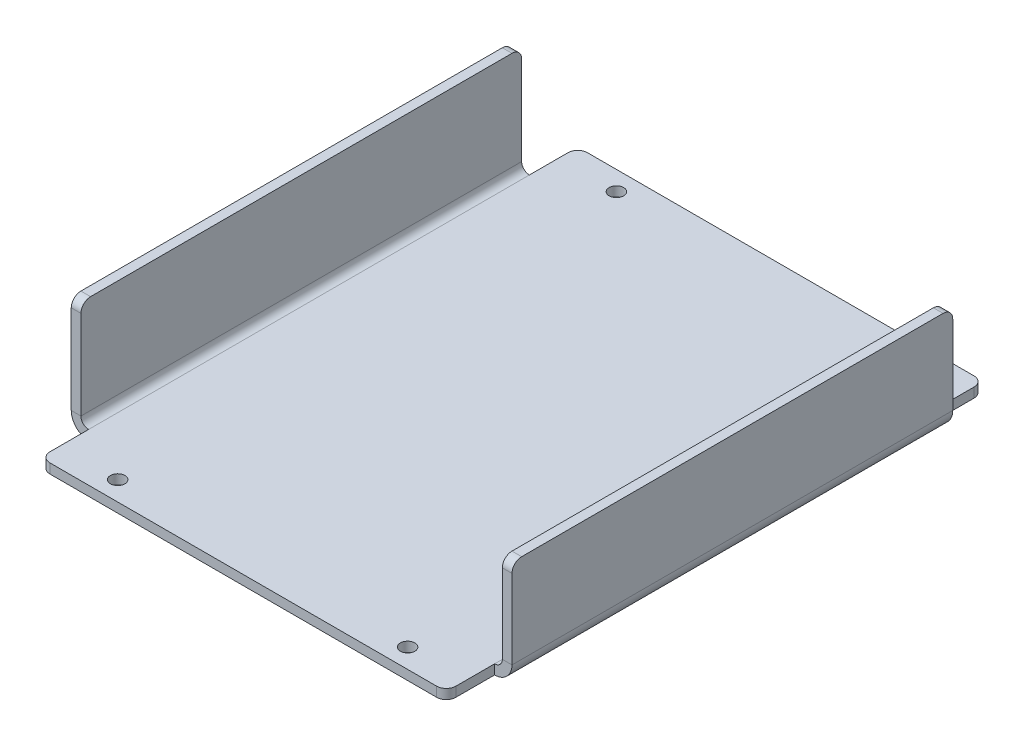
ISO-10303-21;
HEADER;
FILE_DESCRIPTION(('STEP AP214'),'2;1');
FILE_NAME('part.step','',(''),(''),'','','');
FILE_SCHEMA(('AUTOMOTIVE_DESIGN { 1 0 10303 214 1 1 1 1 }'));
ENDSEC;
DATA;
#1=APPLICATION_CONTEXT('core data for automotive mechanical design processes');
#2=APPLICATION_PROTOCOL_DEFINITION('international standard','automotive_design',2000,#1);
#3=PRODUCT_CONTEXT('',#1,'mechanical');
#4=PRODUCT('Part','Part','',(#3));
#5=PRODUCT_RELATED_PRODUCT_CATEGORY('part','',(#4));
#6=PRODUCT_DEFINITION_FORMATION('','',#4);
#7=PRODUCT_DEFINITION_CONTEXT('part definition',#1,'design');
#8=PRODUCT_DEFINITION('design','',#6,#7);
#9=PRODUCT_DEFINITION_SHAPE('','',#8);
#10=(LENGTH_UNIT() NAMED_UNIT(*) SI_UNIT(.MILLI.,.METRE.));
#11=(NAMED_UNIT(*) PLANE_ANGLE_UNIT() SI_UNIT($,.RADIAN.));
#12=(NAMED_UNIT(*) SI_UNIT($,.STERADIAN.) SOLID_ANGLE_UNIT());
#13=UNCERTAINTY_MEASURE_WITH_UNIT(LENGTH_MEASURE(1.E-05),#10,'distance_accuracy_value','');
#14=(GEOMETRIC_REPRESENTATION_CONTEXT(3) GLOBAL_UNCERTAINTY_ASSIGNED_CONTEXT((#13)) GLOBAL_UNIT_ASSIGNED_CONTEXT((#10,
#11,#12)) REPRESENTATION_CONTEXT('',''));
#15=CARTESIAN_POINT('',(0.,0.,0.));
#16=DIRECTION('',(0.,0.,1.));
#17=DIRECTION('',(1.,0.,0.));
#18=AXIS2_PLACEMENT_3D('',#15,#16,#17);
#19=CARTESIAN_POINT('',(-105.,3.99999999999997,278.));
#20=DIRECTION('',(0.,0.,-1.));
#21=DIRECTION('',(-1.,0.,0.));
#22=AXIS2_PLACEMENT_3D('',#19,#20,#21);
#23=CYLINDRICAL_SURFACE('',#22,4.);
#24=DIRECTION('',(0.,0.,-1.));
#25=VECTOR('',#24,1.);
#26=CARTESIAN_POINT('',(-109.,3.99999999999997,278.));
#27=LINE('',#26,#25);
#28=CARTESIAN_POINT('',(-109.,3.99999999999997,253.));
#29=VERTEX_POINT('',#28);
#30=CARTESIAN_POINT('',(-109.,3.99999999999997,25.));
#31=VERTEX_POINT('',#30);
#32=EDGE_CURVE('E237',#29,#31,#27,.T.);
#33=ORIENTED_EDGE('',*,*,#32,.F.);
#34=CARTESIAN_POINT('',(-105.,3.99999999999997,253.));
#35=DIRECTION('',(0.,0.,-1.));
#36=DIRECTION('',(-1.,0.,0.));
#37=AXIS2_PLACEMENT_3D('',#34,#35,#36);
#38=CIRCLE('',#37,4.);
#39=CARTESIAN_POINT('',(-105.,0.,253.));
#40=VERTEX_POINT('',#39);
#41=EDGE_CURVE('E226',#40,#29,#38,.T.);
#42=ORIENTED_EDGE('',*,*,#41,.F.);
#43=DIRECTION('',(0.,0.,-1.));
#44=VECTOR('',#43,1.);
#45=CARTESIAN_POINT('',(-105.,0.,278.));
#46=LINE('',#45,#44);
#47=CARTESIAN_POINT('',(-105.,0.,25.));
#48=VERTEX_POINT('',#47);
#49=EDGE_CURVE('E220',#40,#48,#46,.T.);
#50=ORIENTED_EDGE('',*,*,#49,.T.);
#51=CARTESIAN_POINT('',(-105.,3.99999999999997,25.));
#52=DIRECTION('',(0.,0.,1.));
#53=DIRECTION('',(1.,0.,0.));
#54=AXIS2_PLACEMENT_3D('',#51,#52,#53);
#55=CIRCLE('',#54,4.);
#56=EDGE_CURVE('E334',#31,#48,#55,.T.);
#57=ORIENTED_EDGE('',*,*,#56,.F.);
#58=EDGE_LOOP('',(#33,#42,#50,#57));
#59=FACE_BOUND('',#58,.T.);
#60=ADVANCED_FACE('F46',(#59),#23,.F.);
#61=CARTESIAN_POINT('',(-109.,0.,278.));
#62=DIRECTION('',(1.,0.,0.));
#63=DIRECTION('',(0.,0.,-1.));
#64=AXIS2_PLACEMENT_3D('',#61,#62,#63);
#65=PLANE('',#64);
#66=DIRECTION('',(0.,-1.,0.));
#67=VECTOR('',#66,1.);
#68=CARTESIAN_POINT('',(-109.,0.,25.));
#69=LINE('',#68,#67);
#70=CARTESIAN_POINT('',(-109.,50.,25.));
#71=VERTEX_POINT('',#70);
#72=EDGE_CURVE('E351',#71,#31,#69,.T.);
#73=ORIENTED_EDGE('',*,*,#72,.F.);
#74=CARTESIAN_POINT('',(-109.,50.,30.));
#75=DIRECTION('',(1.,0.,0.));
#76=DIRECTION('',(0.,0.,-1.));
#77=AXIS2_PLACEMENT_3D('',#74,#75,#76);
#78=CIRCLE('',#77,5.);
#79=CARTESIAN_POINT('',(-109.,55.,30.));
#80=VERTEX_POINT('',#79);
#81=EDGE_CURVE('E292',#71,#80,#78,.T.);
#82=ORIENTED_EDGE('',*,*,#81,.T.);
#83=DIRECTION('',(0.,0.,-1.));
#84=VECTOR('',#83,1.);
#85=CARTESIAN_POINT('',(-109.,55.,278.));
#86=LINE('',#85,#84);
#87=CARTESIAN_POINT('',(-109.,55.,248.));
#88=VERTEX_POINT('',#87);
#89=EDGE_CURVE('E245',#88,#80,#86,.T.);
#90=ORIENTED_EDGE('',*,*,#89,.F.);
#91=CARTESIAN_POINT('',(-109.,50.,248.));
#92=DIRECTION('',(1.,0.,0.));
#93=DIRECTION('',(0.,0.,-1.));
#94=AXIS2_PLACEMENT_3D('',#91,#92,#93);
#95=CIRCLE('',#94,5.);
#96=CARTESIAN_POINT('',(-109.,50.,253.));
#97=VERTEX_POINT('',#96);
#98=EDGE_CURVE('E290',#88,#97,#95,.T.);
#99=ORIENTED_EDGE('',*,*,#98,.T.);
#100=DIRECTION('',(0.,1.,0.));
#101=VECTOR('',#100,1.);
#102=CARTESIAN_POINT('',(-109.,0.,253.));
#103=LINE('',#102,#101);
#104=EDGE_CURVE('E442',#29,#97,#103,.T.);
#105=ORIENTED_EDGE('',*,*,#104,.F.);
#106=ORIENTED_EDGE('',*,*,#32,.T.);
#107=EDGE_LOOP('',(#73,#82,#90,#99,#105,#106));
#108=FACE_BOUND('',#107,.T.);
#109=ADVANCED_FACE('F449',(#108),#65,.T.);
#110=CARTESIAN_POINT('',(-114.,55.,278.));
#111=DIRECTION('',(0.,1.,0.));
#112=DIRECTION('',(0.,0.,1.));
#113=AXIS2_PLACEMENT_3D('',#110,#111,#112);
#114=PLANE('',#113);
#115=ORIENTED_EDGE('',*,*,#89,.T.);
#116=DIRECTION('',(1.,0.,0.));
#117=VECTOR('',#116,1.);
#118=CARTESIAN_POINT('',(-114.,55.,30.));
#119=LINE('',#118,#117);
#120=CARTESIAN_POINT('',(-114.,55.,30.));
#121=VERTEX_POINT('',#120);
#122=EDGE_CURVE('E281',#80,#121,#119,.F.);
#123=ORIENTED_EDGE('',*,*,#122,.T.);
#124=DIRECTION('',(0.,0.,-1.));
#125=VECTOR('',#124,1.);
#126=CARTESIAN_POINT('',(-114.,55.,278.));
#127=LINE('',#126,#125);
#128=CARTESIAN_POINT('',(-114.,55.,248.));
#129=VERTEX_POINT('',#128);
#130=EDGE_CURVE('E411',#129,#121,#127,.T.);
#131=ORIENTED_EDGE('',*,*,#130,.F.);
#132=DIRECTION('',(-1.,0.,0.));
#133=VECTOR('',#132,1.);
#134=CARTESIAN_POINT('',(-114.,55.,248.));
#135=LINE('',#134,#133);
#136=EDGE_CURVE('E278',#129,#88,#135,.F.);
#137=ORIENTED_EDGE('',*,*,#136,.T.);
#138=EDGE_LOOP('',(#115,#123,#131,#137));
#139=FACE_BOUND('',#138,.T.);
#140=ADVANCED_FACE('F417',(#139),#114,.T.);
#141=CARTESIAN_POINT('',(-114.,0.,278.));
#142=DIRECTION('',(1.,0.,0.));
#143=DIRECTION('',(0.,0.,-1.));
#144=AXIS2_PLACEMENT_3D('',#141,#142,#143);
#145=PLANE('',#144);
#146=ORIENTED_EDGE('',*,*,#130,.T.);
#147=CARTESIAN_POINT('',(-114.,50.,30.));
#148=DIRECTION('',(1.,0.,0.));
#149=DIRECTION('',(0.,0.,-1.));
#150=AXIS2_PLACEMENT_3D('',#147,#148,#149);
#151=CIRCLE('',#150,5.);
#152=CARTESIAN_POINT('',(-114.,50.,25.));
#153=VERTEX_POINT('',#152);
#154=EDGE_CURVE('E286',#121,#153,#151,.F.);
#155=ORIENTED_EDGE('',*,*,#154,.T.);
#156=DIRECTION('',(0.,1.,0.));
#157=VECTOR('',#156,1.);
#158=CARTESIAN_POINT('',(-114.,0.,25.));
#159=LINE('',#158,#157);
#160=CARTESIAN_POINT('',(-114.,3.99999999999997,25.));
#161=VERTEX_POINT('',#160);
#162=EDGE_CURVE('E353',#153,#161,#159,.F.);
#163=ORIENTED_EDGE('',*,*,#162,.T.);
#164=DIRECTION('',(0.,0.,-1.));
#165=VECTOR('',#164,1.);
#166=CARTESIAN_POINT('',(-114.,3.99999999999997,278.));
#167=LINE('',#166,#165);
#168=CARTESIAN_POINT('',(-114.,3.99999999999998,253.));
#169=VERTEX_POINT('',#168);
#170=EDGE_CURVE('E408',#169,#161,#167,.T.);
#171=ORIENTED_EDGE('',*,*,#170,.F.);
#172=DIRECTION('',(0.,1.,0.));
#173=VECTOR('',#172,1.);
#174=CARTESIAN_POINT('',(-114.,55.,253.));
#175=LINE('',#174,#173);
#176=CARTESIAN_POINT('',(-114.,50.,253.));
#177=VERTEX_POINT('',#176);
#178=EDGE_CURVE('E238',#169,#177,#175,.T.);
#179=ORIENTED_EDGE('',*,*,#178,.T.);
#180=CARTESIAN_POINT('',(-114.,50.,248.));
#181=DIRECTION('',(1.,0.,0.));
#182=DIRECTION('',(0.,0.,-1.));
#183=AXIS2_PLACEMENT_3D('',#180,#181,#182);
#184=CIRCLE('',#183,5.);
#185=EDGE_CURVE('E284',#177,#129,#184,.F.);
#186=ORIENTED_EDGE('',*,*,#185,.T.);
#187=EDGE_LOOP('',(#146,#155,#163,#171,#179,#186));
#188=FACE_BOUND('',#187,.T.);
#189=ADVANCED_FACE('F427',(#188),#145,.F.);
#190=CARTESIAN_POINT('',(-105.,3.99999999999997,278.));
#191=DIRECTION('',(0.,0.,-1.));
#192=DIRECTION('',(-1.,0.,0.));
#193=AXIS2_PLACEMENT_3D('',#190,#191,#192);
#194=CYLINDRICAL_SURFACE('',#193,9.);
#195=CARTESIAN_POINT('',(-105.,3.99999999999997,253.));
#196=DIRECTION('',(0.,0.,-1.));
#197=DIRECTION('',(-1.,0.,0.));
#198=AXIS2_PLACEMENT_3D('',#195,#196,#197);
#199=CIRCLE('',#198,9.);
#200=CARTESIAN_POINT('',(-105.,-5.00000000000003,253.));
#201=VERTEX_POINT('',#200);
#202=EDGE_CURVE('E229',#201,#169,#199,.T.);
#203=ORIENTED_EDGE('',*,*,#202,.T.);
#204=ORIENTED_EDGE('',*,*,#170,.T.);
#205=CARTESIAN_POINT('',(-105.,3.99999999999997,25.));
#206=DIRECTION('',(0.,0.,-1.));
#207=DIRECTION('',(-1.,0.,0.));
#208=AXIS2_PLACEMENT_3D('',#205,#206,#207);
#209=CIRCLE('',#208,9.);
#210=CARTESIAN_POINT('',(-105.,-5.00000000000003,25.));
#211=VERTEX_POINT('',#210);
#212=EDGE_CURVE('E342',#161,#211,#209,.F.);
#213=ORIENTED_EDGE('',*,*,#212,.T.);
#214=DIRECTION('',(0.,0.,-1.));
#215=VECTOR('',#214,1.);
#216=CARTESIAN_POINT('',(-105.,-5.00000000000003,278.));
#217=LINE('',#216,#215);
#218=EDGE_CURVE('E405',#201,#211,#217,.T.);
#219=ORIENTED_EDGE('',*,*,#218,.F.);
#220=EDGE_LOOP('',(#203,#204,#213,#219));
#221=FACE_BOUND('',#220,.T.);
#222=ADVANCED_FACE('F438',(#221),#194,.T.);
#223=CARTESIAN_POINT('',(114.,0.,278.));
#224=DIRECTION('',(-1.,0.,0.));
#225=DIRECTION('',(0.,0.,1.));
#226=AXIS2_PLACEMENT_3D('',#223,#224,#225);
#227=PLANE('',#226);
#228=DIRECTION('',(0.,-1.,0.));
#229=VECTOR('',#228,1.);
#230=CARTESIAN_POINT('',(114.,55.,25.));
#231=LINE('',#230,#229);
#232=CARTESIAN_POINT('',(114.,45.,25.));
#233=VERTEX_POINT('',#232);
#234=CARTESIAN_POINT('',(114.,3.99999999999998,25.));
#235=VERTEX_POINT('',#234);
#236=EDGE_CURVE('E469',#233,#235,#231,.T.);
#237=ORIENTED_EDGE('',*,*,#236,.F.);
#238=CARTESIAN_POINT('',(114.,45.,30.));
#239=DIRECTION('',(-1.,0.,0.));
#240=DIRECTION('',(0.,0.,1.));
#241=AXIS2_PLACEMENT_3D('',#238,#239,#240);
#242=CIRCLE('',#241,5.);
#243=CARTESIAN_POINT('',(114.,50.,30.));
#244=VERTEX_POINT('',#243);
#245=EDGE_CURVE('E305',#233,#244,#242,.F.);
#246=ORIENTED_EDGE('',*,*,#245,.T.);
#247=DIRECTION('',(0.,0.,-1.));
#248=VECTOR('',#247,1.);
#249=CARTESIAN_POINT('',(114.,50.,278.001));
#250=LINE('',#249,#248);
#251=CARTESIAN_POINT('',(114.,50.,248.));
#252=VERTEX_POINT('',#251);
#253=EDGE_CURVE('E358',#252,#244,#250,.T.);
#254=ORIENTED_EDGE('',*,*,#253,.F.);
#255=CARTESIAN_POINT('',(114.,45.,248.));
#256=DIRECTION('',(-1.,0.,0.));
#257=DIRECTION('',(0.,0.,1.));
#258=AXIS2_PLACEMENT_3D('',#255,#256,#257);
#259=CIRCLE('',#258,5.);
#260=CARTESIAN_POINT('',(114.,45.,253.));
#261=VERTEX_POINT('',#260);
#262=EDGE_CURVE('E61',#252,#261,#259,.F.);
#263=ORIENTED_EDGE('',*,*,#262,.T.);
#264=DIRECTION('',(0.,1.,0.));
#265=VECTOR('',#264,1.);
#266=CARTESIAN_POINT('',(114.,55.,253.));
#267=LINE('',#266,#265);
#268=CARTESIAN_POINT('',(114.,3.99999999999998,253.));
#269=VERTEX_POINT('',#268);
#270=EDGE_CURVE('E325',#269,#261,#267,.T.);
#271=ORIENTED_EDGE('',*,*,#270,.F.);
#272=DIRECTION('',(0.,0.,-1.));
#273=VECTOR('',#272,1.);
#274=CARTESIAN_POINT('',(114.,3.99999999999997,278.));
#275=LINE('',#274,#273);
#276=EDGE_CURVE('E399',#269,#235,#275,.T.);
#277=ORIENTED_EDGE('',*,*,#276,.T.);
#278=EDGE_LOOP('',(#237,#246,#254,#263,#271,#277));
#279=FACE_BOUND('',#278,.T.);
#280=ADVANCED_FACE('F515',(#279),#227,.F.);
#281=CARTESIAN_POINT('',(109.,0.,278.));
#282=DIRECTION('',(-1.,0.,0.));
#283=DIRECTION('',(0.,0.,1.));
#284=AXIS2_PLACEMENT_3D('',#281,#282,#283);
#285=PLANE('',#284);
#286=DIRECTION('',(0.,0.,-1.));
#287=VECTOR('',#286,1.);
#288=CARTESIAN_POINT('',(109.,50.,278.001));
#289=LINE('',#288,#287);
#290=CARTESIAN_POINT('',(109.,50.,248.));
#291=VERTEX_POINT('',#290);
#292=CARTESIAN_POINT('',(109.,50.,30.));
#293=VERTEX_POINT('',#292);
#294=EDGE_CURVE('E359',#291,#293,#289,.T.);
#295=ORIENTED_EDGE('',*,*,#294,.T.);
#296=CARTESIAN_POINT('',(109.,45.,30.));
#297=DIRECTION('',(-1.,0.,0.));
#298=DIRECTION('',(0.,0.,1.));
#299=AXIS2_PLACEMENT_3D('',#296,#297,#298);
#300=CIRCLE('',#299,5.);
#301=CARTESIAN_POINT('',(109.,45.,25.));
#302=VERTEX_POINT('',#301);
#303=EDGE_CURVE('E301',#293,#302,#300,.T.);
#304=ORIENTED_EDGE('',*,*,#303,.T.);
#305=DIRECTION('',(0.,1.,0.));
#306=VECTOR('',#305,1.);
#307=CARTESIAN_POINT('',(109.,0.,25.));
#308=LINE('',#307,#306);
#309=CARTESIAN_POINT('',(109.,3.99999999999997,25.));
#310=VERTEX_POINT('',#309);
#311=EDGE_CURVE('E471',#302,#310,#308,.F.);
#312=ORIENTED_EDGE('',*,*,#311,.T.);
#313=DIRECTION('',(0.,0.,-1.));
#314=VECTOR('',#313,1.);
#315=CARTESIAN_POINT('',(109.,3.99999999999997,278.));
#316=LINE('',#315,#314);
#317=CARTESIAN_POINT('',(109.,3.99999999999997,253.));
#318=VERTEX_POINT('',#317);
#319=EDGE_CURVE('E251',#318,#310,#316,.T.);
#320=ORIENTED_EDGE('',*,*,#319,.F.);
#321=DIRECTION('',(0.,1.,0.));
#322=VECTOR('',#321,1.);
#323=CARTESIAN_POINT('',(109.,0.,253.));
#324=LINE('',#323,#322);
#325=CARTESIAN_POINT('',(109.,45.,253.));
#326=VERTEX_POINT('',#325);
#327=EDGE_CURVE('E323',#318,#326,#324,.T.);
#328=ORIENTED_EDGE('',*,*,#327,.T.);
#329=CARTESIAN_POINT('',(109.,45.,248.));
#330=DIRECTION('',(-1.,0.,0.));
#331=DIRECTION('',(0.,0.,1.));
#332=AXIS2_PLACEMENT_3D('',#329,#330,#331);
#333=CIRCLE('',#332,5.);
#334=EDGE_CURVE('E299',#326,#291,#333,.T.);
#335=ORIENTED_EDGE('',*,*,#334,.T.);
#336=EDGE_LOOP('',(#295,#304,#312,#320,#328,#335));
#337=FACE_BOUND('',#336,.T.);
#338=ADVANCED_FACE('F330',(#337),#285,.T.);
#339=CARTESIAN_POINT('',(105.,3.99999999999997,278.));
#340=DIRECTION('',(0.,0.,-1.));
#341=DIRECTION('',(-1.,0.,0.));
#342=AXIS2_PLACEMENT_3D('',#339,#340,#341);
#343=CYLINDRICAL_SURFACE('',#342,4.);
#344=ORIENTED_EDGE('',*,*,#319,.T.);
#345=CARTESIAN_POINT('',(105.,3.99999999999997,25.));
#346=DIRECTION('',(0.,0.,-1.));
#347=DIRECTION('',(-1.,0.,0.));
#348=AXIS2_PLACEMENT_3D('',#345,#346,#347);
#349=CIRCLE('',#348,4.);
#350=CARTESIAN_POINT('',(105.,0.,25.));
#351=VERTEX_POINT('',#350);
#352=EDGE_CURVE('E466',#351,#310,#349,.F.);
#353=ORIENTED_EDGE('',*,*,#352,.F.);
#354=DIRECTION('',(0.,0.,-1.));
#355=VECTOR('',#354,1.);
#356=CARTESIAN_POINT('',(105.,0.,278.));
#357=LINE('',#356,#355);
#358=CARTESIAN_POINT('',(105.,0.,253.));
#359=VERTEX_POINT('',#358);
#360=EDGE_CURVE('E219',#359,#351,#357,.T.);
#361=ORIENTED_EDGE('',*,*,#360,.F.);
#362=CARTESIAN_POINT('',(105.,3.99999999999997,253.));
#363=DIRECTION('',(0.,0.,-1.));
#364=DIRECTION('',(-1.,0.,0.));
#365=AXIS2_PLACEMENT_3D('',#362,#363,#364);
#366=CIRCLE('',#365,4.);
#367=EDGE_CURVE('E336',#318,#359,#366,.T.);
#368=ORIENTED_EDGE('',*,*,#367,.F.);
#369=EDGE_LOOP('',(#344,#353,#361,#368));
#370=FACE_BOUND('',#369,.T.);
#371=ADVANCED_FACE('F496',(#370),#343,.F.);
#372=CARTESIAN_POINT('',(105.,3.99999999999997,278.));
#373=DIRECTION('',(0.,0.,-1.));
#374=DIRECTION('',(-1.,0.,0.));
#375=AXIS2_PLACEMENT_3D('',#372,#373,#374);
#376=CYLINDRICAL_SURFACE('',#375,9.);
#377=CARTESIAN_POINT('',(105.,3.99999999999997,25.));
#378=DIRECTION('',(0.,0.,1.));
#379=DIRECTION('',(1.,0.,0.));
#380=AXIS2_PLACEMENT_3D('',#377,#378,#379);
#381=CIRCLE('',#380,9.);
#382=CARTESIAN_POINT('',(105.,-5.00000000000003,25.0000000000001));
#383=VERTEX_POINT('',#382);
#384=EDGE_CURVE('E463',#383,#235,#381,.T.);
#385=ORIENTED_EDGE('',*,*,#384,.T.);
#386=ORIENTED_EDGE('',*,*,#276,.F.);
#387=CARTESIAN_POINT('',(105.,3.99999999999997,253.));
#388=DIRECTION('',(0.,0.,-1.));
#389=DIRECTION('',(-1.,0.,0.));
#390=AXIS2_PLACEMENT_3D('',#387,#388,#389);
#391=CIRCLE('',#390,9.);
#392=CARTESIAN_POINT('',(105.,-5.00000000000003,253.));
#393=VERTEX_POINT('',#392);
#394=EDGE_CURVE('E479',#269,#393,#391,.T.);
#395=ORIENTED_EDGE('',*,*,#394,.T.);
#396=DIRECTION('',(0.,0.,-1.));
#397=VECTOR('',#396,1.);
#398=CARTESIAN_POINT('',(105.,-5.00000000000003,278.));
#399=LINE('',#398,#397);
#400=EDGE_CURVE('E402',#393,#383,#399,.T.);
#401=ORIENTED_EDGE('',*,*,#400,.T.);
#402=EDGE_LOOP('',(#385,#386,#395,#401));
#403=FACE_BOUND('',#402,.T.);
#404=ADVANCED_FACE('F512',(#403),#376,.T.);
#405=CARTESIAN_POINT('',(114.,50.,278.001));
#406=DIRECTION('',(0.,-1.,0.));
#407=DIRECTION('',(0.,0.,-1.));
#408=AXIS2_PLACEMENT_3D('',#405,#406,#407);
#409=PLANE('',#408);
#410=ORIENTED_EDGE('',*,*,#253,.T.);
#411=DIRECTION('',(-1.,0.,0.));
#412=VECTOR('',#411,1.);
#413=CARTESIAN_POINT('',(109.,50.,30.));
#414=LINE('',#413,#412);
#415=EDGE_CURVE('E296',#244,#293,#414,.T.);
#416=ORIENTED_EDGE('',*,*,#415,.T.);
#417=ORIENTED_EDGE('',*,*,#294,.F.);
#418=DIRECTION('',(-1.,0.,0.));
#419=VECTOR('',#418,1.);
#420=CARTESIAN_POINT('',(114.,50.,248.));
#421=LINE('',#420,#419);
#422=EDGE_CURVE('E294',#291,#252,#421,.F.);
#423=ORIENTED_EDGE('',*,*,#422,.T.);
#424=EDGE_LOOP('',(#410,#416,#417,#423));
#425=FACE_BOUND('',#424,.T.);
#426=ADVANCED_FACE('F522',(#425),#409,.F.);
#427=CARTESIAN_POINT('',(-114.,3.99999999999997,278.));
#428=DIRECTION('',(0.,0.,1.));
#429=DIRECTION('',(1.,0.,0.));
#430=AXIS2_PLACEMENT_3D('',#427,#428,#429);
#431=PLANE('',#430);
#432=DIRECTION('',(1.,0.,0.));
#433=VECTOR('',#432,1.);
#434=CARTESIAN_POINT('',(109.,-5.00000000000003,278.));
#435=LINE('',#434,#433);
#436=CARTESIAN_POINT('',(-100.,-5.00000000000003,278.));
#437=VERTEX_POINT('',#436);
#438=CARTESIAN_POINT('',(100.,-5.00000000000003,278.));
#439=VERTEX_POINT('',#438);
#440=EDGE_CURVE('E396',#437,#439,#435,.T.);
#441=ORIENTED_EDGE('',*,*,#440,.T.);
#442=DIRECTION('',(0.,-1.,0.));
#443=VECTOR('',#442,1.);
#444=CARTESIAN_POINT('',(100.,3.99999999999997,278.));
#445=LINE('',#444,#443);
#446=CARTESIAN_POINT('',(100.,0.,278.));
#447=VERTEX_POINT('',#446);
#448=EDGE_CURVE('E312',#439,#447,#445,.F.);
#449=ORIENTED_EDGE('',*,*,#448,.T.);
#450=DIRECTION('',(1.,0.,0.));
#451=VECTOR('',#450,1.);
#452=CARTESIAN_POINT('',(109.,0.,278.));
#453=LINE('',#452,#451);
#454=CARTESIAN_POINT('',(-100.,0.,278.));
#455=VERTEX_POINT('',#454);
#456=EDGE_CURVE('E393',#455,#447,#453,.T.);
#457=ORIENTED_EDGE('',*,*,#456,.F.);
#458=DIRECTION('',(0.,-1.,0.));
#459=VECTOR('',#458,1.);
#460=CARTESIAN_POINT('',(-100.,3.99999999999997,278.));
#461=LINE('',#460,#459);
#462=EDGE_CURVE('E309',#455,#437,#461,.T.);
#463=ORIENTED_EDGE('',*,*,#462,.T.);
#464=EDGE_LOOP('',(#441,#449,#457,#463));
#465=FACE_BOUND('',#464,.T.);
#466=ADVANCED_FACE('F48',(#465),#431,.T.);
#467=CARTESIAN_POINT('',(114.,3.99999999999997,0.));
#468=DIRECTION('',(0.,0.,-1.));
#469=DIRECTION('',(-1.,0.,0.));
#470=AXIS2_PLACEMENT_3D('',#467,#468,#469);
#471=PLANE('',#470);
#472=DIRECTION('',(1.,0.,0.));
#473=VECTOR('',#472,1.);
#474=CARTESIAN_POINT('',(109.,-5.00000000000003,0.));
#475=LINE('',#474,#473);
#476=CARTESIAN_POINT('',(-100.,-5.00000000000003,0.));
#477=VERTEX_POINT('',#476);
#478=CARTESIAN_POINT('',(100.,-5.00000000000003,0.));
#479=VERTEX_POINT('',#478);
#480=EDGE_CURVE('E390',#477,#479,#475,.T.);
#481=ORIENTED_EDGE('',*,*,#480,.F.);
#482=DIRECTION('',(0.,1.,0.));
#483=VECTOR('',#482,1.);
#484=CARTESIAN_POINT('',(-100.,3.99999999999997,0.));
#485=LINE('',#484,#483);
#486=CARTESIAN_POINT('',(-100.,0.,0.));
#487=VERTEX_POINT('',#486);
#488=EDGE_CURVE('E257',#477,#487,#485,.T.);
#489=ORIENTED_EDGE('',*,*,#488,.T.);
#490=DIRECTION('',(1.,0.,0.));
#491=VECTOR('',#490,1.);
#492=CARTESIAN_POINT('',(109.,0.,0.));
#493=LINE('',#492,#491);
#494=CARTESIAN_POINT('',(100.,0.,0.));
#495=VERTEX_POINT('',#494);
#496=EDGE_CURVE('E387',#487,#495,#493,.T.);
#497=ORIENTED_EDGE('',*,*,#496,.T.);
#498=DIRECTION('',(0.,1.,0.));
#499=VECTOR('',#498,1.);
#500=CARTESIAN_POINT('',(100.,3.99999999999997,0.));
#501=LINE('',#500,#499);
#502=EDGE_CURVE('E254',#495,#479,#501,.F.);
#503=ORIENTED_EDGE('',*,*,#502,.T.);
#504=EDGE_LOOP('',(#481,#489,#497,#503));
#505=FACE_BOUND('',#504,.T.);
#506=ADVANCED_FACE('F536',(#505),#471,.T.);
#507=CARTESIAN_POINT('',(109.,0.,278.));
#508=DIRECTION('',(0.,1.,0.));
#509=DIRECTION('',(0.,0.,1.));
#510=AXIS2_PLACEMENT_3D('',#507,#508,#509);
#511=PLANE('',#510);
#512=CARTESIAN_POINT('',(75.,0.,10.));
#513=DIRECTION('',(0.,-1.,0.));
#514=DIRECTION('',(0.,0.,-1.));
#515=AXIS2_PLACEMENT_3D('',#512,#513,#514);
#516=CIRCLE('',#515,3.75000000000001);
#517=CARTESIAN_POINT('',(75.,0.,6.25));
#518=VERTEX_POINT('',#517);
#519=EDGE_CURVE('E366',#518,#518,#516,.T.);
#520=ORIENTED_EDGE('',*,*,#519,.T.);
#521=EDGE_LOOP('',(#520));
#522=FACE_BOUND('',#521,.T.);
#523=CARTESIAN_POINT('',(-75.,0.,10.));
#524=DIRECTION('',(0.,-1.,0.));
#525=DIRECTION('',(0.,0.,-1.));
#526=AXIS2_PLACEMENT_3D('',#523,#524,#525);
#527=CIRCLE('',#526,3.75000000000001);
#528=CARTESIAN_POINT('',(-75.,0.,6.25));
#529=VERTEX_POINT('',#528);
#530=EDGE_CURVE('E372',#529,#529,#527,.T.);
#531=ORIENTED_EDGE('',*,*,#530,.T.);
#532=EDGE_LOOP('',(#531));
#533=FACE_BOUND('',#532,.T.);
#534=CARTESIAN_POINT('',(-75.,0.,268.));
#535=DIRECTION('',(0.,-1.,0.));
#536=DIRECTION('',(0.,0.,-1.));
#537=AXIS2_PLACEMENT_3D('',#534,#535,#536);
#538=CIRCLE('',#537,3.75000000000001);
#539=CARTESIAN_POINT('',(-75.,0.,264.25));
#540=VERTEX_POINT('',#539);
#541=EDGE_CURVE('E378',#540,#540,#538,.T.);
#542=ORIENTED_EDGE('',*,*,#541,.T.);
#543=EDGE_LOOP('',(#542));
#544=FACE_BOUND('',#543,.T.);
#545=CARTESIAN_POINT('',(75.,0.,268.));
#546=DIRECTION('',(0.,-1.,0.));
#547=DIRECTION('',(0.,0.,-1.));
#548=AXIS2_PLACEMENT_3D('',#545,#546,#547);
#549=CIRCLE('',#548,3.75000000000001);
#550=CARTESIAN_POINT('',(75.,0.,264.25));
#551=VERTEX_POINT('',#550);
#552=EDGE_CURVE('E384',#551,#551,#549,.T.);
#553=ORIENTED_EDGE('',*,*,#552,.T.);
#554=EDGE_LOOP('',(#553));
#555=FACE_BOUND('',#554,.T.);
#556=ORIENTED_EDGE('',*,*,#496,.F.);
#557=CARTESIAN_POINT('',(-100.,0.,5.));
#558=DIRECTION('',(0.,1.,0.));
#559=DIRECTION('',(0.,0.,1.));
#560=AXIS2_PLACEMENT_3D('',#557,#558,#559);
#561=CIRCLE('',#560,5.);
#562=CARTESIAN_POINT('',(-105.,0.,5.));
#563=VERTEX_POINT('',#562);
#564=EDGE_CURVE('E266',#487,#563,#561,.T.);
#565=ORIENTED_EDGE('',*,*,#564,.T.);
#566=DIRECTION('',(0.,0.,-1.));
#567=VECTOR('',#566,1.);
#568=CARTESIAN_POINT('',(-105.,0.,278.));
#569=LINE('',#568,#567);
#570=EDGE_CURVE('E244',#48,#563,#569,.T.);
#571=ORIENTED_EDGE('',*,*,#570,.F.);
#572=ORIENTED_EDGE('',*,*,#49,.F.);
#573=CARTESIAN_POINT('',(-105.,0.,273.));
#574=VERTEX_POINT('',#573);
#575=EDGE_CURVE('E209',#574,#40,#46,.T.);
#576=ORIENTED_EDGE('',*,*,#575,.F.);
#577=CARTESIAN_POINT('',(-100.,0.,273.));
#578=DIRECTION('',(0.,1.,0.));
#579=DIRECTION('',(0.,0.,1.));
#580=AXIS2_PLACEMENT_3D('',#577,#578,#579);
#581=CIRCLE('',#580,5.);
#582=EDGE_CURVE('E260',#574,#455,#581,.T.);
#583=ORIENTED_EDGE('',*,*,#582,.T.);
#584=ORIENTED_EDGE('',*,*,#456,.T.);
#585=CARTESIAN_POINT('',(100.,0.,273.));
#586=DIRECTION('',(0.,1.,0.));
#587=DIRECTION('',(0.,0.,1.));
#588=AXIS2_PLACEMENT_3D('',#585,#586,#587);
#589=CIRCLE('',#588,5.);
#590=CARTESIAN_POINT('',(105.,0.,273.));
#591=VERTEX_POINT('',#590);
#592=EDGE_CURVE('E262',#447,#591,#589,.T.);
#593=ORIENTED_EDGE('',*,*,#592,.T.);
#594=EDGE_CURVE('E249',#591,#359,#357,.T.);
#595=ORIENTED_EDGE('',*,*,#594,.T.);
#596=ORIENTED_EDGE('',*,*,#360,.T.);
#597=DIRECTION('',(0.,0.,-1.));
#598=VECTOR('',#597,1.);
#599=CARTESIAN_POINT('',(105.,0.,278.));
#600=LINE('',#599,#598);
#601=CARTESIAN_POINT('',(105.,0.,5.));
#602=VERTEX_POINT('',#601);
#603=EDGE_CURVE('E453',#351,#602,#600,.T.);
#604=ORIENTED_EDGE('',*,*,#603,.T.);
#605=CARTESIAN_POINT('',(100.,0.,5.));
#606=DIRECTION('',(0.,1.,0.));
#607=DIRECTION('',(0.,0.,1.));
#608=AXIS2_PLACEMENT_3D('',#605,#606,#607);
#609=CIRCLE('',#608,5.);
#610=EDGE_CURVE('E264',#602,#495,#609,.T.);
#611=ORIENTED_EDGE('',*,*,#610,.T.);
#612=EDGE_LOOP('',(#556,#565,#571,#572,#576,#583,#584,#593,#595,#596,#604,#611));
#613=FACE_BOUND('',#612,.T.);
#614=ADVANCED_FACE('F242',(#522,#533,#544,#555,#613),#511,.T.);
#615=CARTESIAN_POINT('',(109.,-5.00000000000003,278.));
#616=DIRECTION('',(0.,1.,0.));
#617=DIRECTION('',(0.,0.,1.));
#618=AXIS2_PLACEMENT_3D('',#615,#616,#617);
#619=PLANE('',#618);
#620=CARTESIAN_POINT('',(75.,-5.00000000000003,10.));
#621=DIRECTION('',(0.,-1.,0.));
#622=DIRECTION('',(0.,0.,-1.));
#623=AXIS2_PLACEMENT_3D('',#620,#621,#622);
#624=CIRCLE('',#623,3.75000000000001);
#625=CARTESIAN_POINT('',(75.,-5.00000000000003,6.25));
#626=VERTEX_POINT('',#625);
#627=EDGE_CURVE('E361',#626,#626,#624,.T.);
#628=ORIENTED_EDGE('',*,*,#627,.F.);
#629=EDGE_LOOP('',(#628));
#630=FACE_BOUND('',#629,.T.);
#631=CARTESIAN_POINT('',(-75.,-5.00000000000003,10.));
#632=DIRECTION('',(0.,-1.,0.));
#633=DIRECTION('',(0.,0.,-1.));
#634=AXIS2_PLACEMENT_3D('',#631,#632,#633);
#635=CIRCLE('',#634,3.75000000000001);
#636=CARTESIAN_POINT('',(-75.,-5.00000000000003,6.25));
#637=VERTEX_POINT('',#636);
#638=EDGE_CURVE('E369',#637,#637,#635,.T.);
#639=ORIENTED_EDGE('',*,*,#638,.F.);
#640=EDGE_LOOP('',(#639));
#641=FACE_BOUND('',#640,.T.);
#642=CARTESIAN_POINT('',(-75.,-5.00000000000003,268.));
#643=DIRECTION('',(0.,-1.,0.));
#644=DIRECTION('',(0.,0.,-1.));
#645=AXIS2_PLACEMENT_3D('',#642,#643,#644);
#646=CIRCLE('',#645,3.75000000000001);
#647=CARTESIAN_POINT('',(-75.,-5.00000000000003,264.25));
#648=VERTEX_POINT('',#647);
#649=EDGE_CURVE('E375',#648,#648,#646,.T.);
#650=ORIENTED_EDGE('',*,*,#649,.F.);
#651=EDGE_LOOP('',(#650));
#652=FACE_BOUND('',#651,.T.);
#653=CARTESIAN_POINT('',(75.,-5.00000000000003,268.));
#654=DIRECTION('',(0.,-1.,0.));
#655=DIRECTION('',(0.,0.,-1.));
#656=AXIS2_PLACEMENT_3D('',#653,#654,#655);
#657=CIRCLE('',#656,3.75000000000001);
#658=CARTESIAN_POINT('',(75.,-5.00000000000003,264.25));
#659=VERTEX_POINT('',#658);
#660=EDGE_CURVE('E381',#659,#659,#657,.T.);
#661=ORIENTED_EDGE('',*,*,#660,.F.);
#662=EDGE_LOOP('',(#661));
#663=FACE_BOUND('',#662,.T.);
#664=DIRECTION('',(0.,0.,-1.));
#665=VECTOR('',#664,1.);
#666=CARTESIAN_POINT('',(-105.,-5.00000000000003,278.));
#667=LINE('',#666,#665);
#668=CARTESIAN_POINT('',(-105.,-5.00000000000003,5.));
#669=VERTEX_POINT('',#668);
#670=EDGE_CURVE('E343',#211,#669,#667,.T.);
#671=ORIENTED_EDGE('',*,*,#670,.T.);
#672=CARTESIAN_POINT('',(-100.,-5.00000000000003,5.));
#673=DIRECTION('',(0.,1.,0.));
#674=DIRECTION('',(0.,0.,1.));
#675=AXIS2_PLACEMENT_3D('',#672,#673,#674);
#676=CIRCLE('',#675,5.);
#677=EDGE_CURVE('E276',#669,#477,#676,.F.);
#678=ORIENTED_EDGE('',*,*,#677,.T.);
#679=ORIENTED_EDGE('',*,*,#480,.T.);
#680=CARTESIAN_POINT('',(100.,-5.00000000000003,5.));
#681=DIRECTION('',(0.,1.,0.));
#682=DIRECTION('',(0.,0.,1.));
#683=AXIS2_PLACEMENT_3D('',#680,#681,#682);
#684=CIRCLE('',#683,5.);
#685=CARTESIAN_POINT('',(105.,-5.00000000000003,5.));
#686=VERTEX_POINT('',#685);
#687=EDGE_CURVE('E274',#479,#686,#684,.F.);
#688=ORIENTED_EDGE('',*,*,#687,.T.);
#689=DIRECTION('',(0.,0.,-1.));
#690=VECTOR('',#689,1.);
#691=CARTESIAN_POINT('',(105.,-5.00000000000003,278.));
#692=LINE('',#691,#690);
#693=EDGE_CURVE('E458',#383,#686,#692,.T.);
#694=ORIENTED_EDGE('',*,*,#693,.F.);
#695=ORIENTED_EDGE('',*,*,#400,.F.);
#696=CARTESIAN_POINT('',(105.,-5.00000000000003,273.));
#697=VERTEX_POINT('',#696);
#698=EDGE_CURVE('E403',#697,#393,#399,.T.);
#699=ORIENTED_EDGE('',*,*,#698,.F.);
#700=CARTESIAN_POINT('',(100.,-5.00000000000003,273.));
#701=DIRECTION('',(0.,1.,0.));
#702=DIRECTION('',(0.,0.,1.));
#703=AXIS2_PLACEMENT_3D('',#700,#701,#702);
#704=CIRCLE('',#703,5.);
#705=EDGE_CURVE('E272',#697,#439,#704,.F.);
#706=ORIENTED_EDGE('',*,*,#705,.T.);
#707=ORIENTED_EDGE('',*,*,#440,.F.);
#708=CARTESIAN_POINT('',(-100.,-5.00000000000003,273.));
#709=DIRECTION('',(0.,1.,0.));
#710=DIRECTION('',(0.,0.,1.));
#711=AXIS2_PLACEMENT_3D('',#708,#709,#710);
#712=CIRCLE('',#711,5.);
#713=CARTESIAN_POINT('',(-105.,-5.00000000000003,273.));
#714=VERTEX_POINT('',#713);
#715=EDGE_CURVE('E270',#437,#714,#712,.F.);
#716=ORIENTED_EDGE('',*,*,#715,.T.);
#717=EDGE_CURVE('E406',#714,#201,#217,.T.);
#718=ORIENTED_EDGE('',*,*,#717,.T.);
#719=ORIENTED_EDGE('',*,*,#218,.T.);
#720=EDGE_LOOP('',(#671,#678,#679,#688,#694,#695,#699,#706,#707,#716,#718,#719));
#721=FACE_BOUND('',#720,.T.);
#722=ADVANCED_FACE('F507',(#630,#641,#652,#663,#721),#619,.F.);
#723=CARTESIAN_POINT('',(75.,0.,268.));
#724=DIRECTION('',(0.,-1.,0.));
#725=DIRECTION('',(0.,0.,-1.));
#726=AXIS2_PLACEMENT_3D('',#723,#724,#725);
#727=CYLINDRICAL_SURFACE('',#726,3.75000000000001);
#728=ORIENTED_EDGE('',*,*,#552,.F.);
#729=EDGE_LOOP('',(#728));
#730=FACE_BOUND('',#729,.T.);
#731=ORIENTED_EDGE('',*,*,#660,.T.);
#732=EDGE_LOOP('',(#731));
#733=FACE_BOUND('',#732,.T.);
#734=ADVANCED_FACE('F598',(#730,#733),#727,.F.);
#735=CARTESIAN_POINT('',(-75.,0.,268.));
#736=DIRECTION('',(0.,-1.,0.));
#737=DIRECTION('',(0.,0.,-1.));
#738=AXIS2_PLACEMENT_3D('',#735,#736,#737);
#739=CYLINDRICAL_SURFACE('',#738,3.75000000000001);
#740=ORIENTED_EDGE('',*,*,#541,.F.);
#741=EDGE_LOOP('',(#740));
#742=FACE_BOUND('',#741,.T.);
#743=ORIENTED_EDGE('',*,*,#649,.T.);
#744=EDGE_LOOP('',(#743));
#745=FACE_BOUND('',#744,.T.);
#746=ADVANCED_FACE('F594',(#742,#745),#739,.F.);
#747=CARTESIAN_POINT('',(-75.,0.,10.));
#748=DIRECTION('',(0.,-1.,0.));
#749=DIRECTION('',(0.,0.,-1.));
#750=AXIS2_PLACEMENT_3D('',#747,#748,#749);
#751=CYLINDRICAL_SURFACE('',#750,3.75000000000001);
#752=ORIENTED_EDGE('',*,*,#530,.F.);
#753=EDGE_LOOP('',(#752));
#754=FACE_BOUND('',#753,.T.);
#755=ORIENTED_EDGE('',*,*,#638,.T.);
#756=EDGE_LOOP('',(#755));
#757=FACE_BOUND('',#756,.T.);
#758=ADVANCED_FACE('F590',(#754,#757),#751,.F.);
#759=CARTESIAN_POINT('',(75.,0.,10.));
#760=DIRECTION('',(0.,-1.,0.));
#761=DIRECTION('',(0.,0.,-1.));
#762=AXIS2_PLACEMENT_3D('',#759,#760,#761);
#763=CYLINDRICAL_SURFACE('',#762,3.75000000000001);
#764=ORIENTED_EDGE('',*,*,#519,.F.);
#765=EDGE_LOOP('',(#764));
#766=FACE_BOUND('',#765,.T.);
#767=ORIENTED_EDGE('',*,*,#627,.T.);
#768=EDGE_LOOP('',(#767));
#769=FACE_BOUND('',#768,.T.);
#770=ADVANCED_FACE('F587',(#766,#769),#763,.F.);
#771=CARTESIAN_POINT('',(-109.,0.,25.));
#772=DIRECTION('',(0.,0.,1.));
#773=DIRECTION('',(0.,-1.,0.));
#774=AXIS2_PLACEMENT_3D('',#771,#772,#773);
#775=PLANE('',#774);
#776=ORIENTED_EDGE('',*,*,#162,.F.);
#777=DIRECTION('',(-1.,0.,0.));
#778=VECTOR('',#777,1.);
#779=CARTESIAN_POINT('',(-109.,50.,25.));
#780=LINE('',#779,#778);
#781=EDGE_CURVE('E288',#153,#71,#780,.F.);
#782=ORIENTED_EDGE('',*,*,#781,.T.);
#783=ORIENTED_EDGE('',*,*,#72,.T.);
#784=DIRECTION('',(1.,0.,0.));
#785=VECTOR('',#784,1.);
#786=CARTESIAN_POINT('',(-109.,3.99999999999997,25.));
#787=LINE('',#786,#785);
#788=EDGE_CURVE('E355',#31,#161,#787,.F.);
#789=ORIENTED_EDGE('',*,*,#788,.T.);
#790=EDGE_LOOP('',(#776,#782,#783,#789));
#791=FACE_BOUND('',#790,.T.);
#792=ADVANCED_FACE('F430',(#791),#775,.F.);
#793=CARTESIAN_POINT('',(-105.,0.,12.5));
#794=DIRECTION('',(-1.,0.,0.));
#795=DIRECTION('',(0.,0.,-1.));
#796=AXIS2_PLACEMENT_3D('',#793,#794,#795);
#797=PLANE('',#796);
#798=ORIENTED_EDGE('',*,*,#570,.T.);
#799=DIRECTION('',(0.,1.,0.));
#800=VECTOR('',#799,1.);
#801=CARTESIAN_POINT('',(-105.,0.,5.));
#802=LINE('',#801,#800);
#803=EDGE_CURVE('E268',#563,#669,#802,.F.);
#804=ORIENTED_EDGE('',*,*,#803,.T.);
#805=ORIENTED_EDGE('',*,*,#670,.F.);
#806=DIRECTION('',(0.,1.,0.));
#807=VECTOR('',#806,1.);
#808=CARTESIAN_POINT('',(-105.,0.,25.));
#809=LINE('',#808,#807);
#810=EDGE_CURVE('E346',#48,#211,#809,.F.);
#811=ORIENTED_EDGE('',*,*,#810,.F.);
#812=EDGE_LOOP('',(#798,#804,#805,#811));
#813=FACE_BOUND('',#812,.T.);
#814=ADVANCED_FACE('F543',(#813),#797,.T.);
#815=CARTESIAN_POINT('',(-105.,3.99999999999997,25.));
#816=DIRECTION('',(0.,0.,-1.));
#817=DIRECTION('',(-1.,0.,0.));
#818=AXIS2_PLACEMENT_3D('',#815,#816,#817);
#819=PLANE('',#818);
#820=ORIENTED_EDGE('',*,*,#212,.F.);
#821=ORIENTED_EDGE('',*,*,#788,.F.);
#822=ORIENTED_EDGE('',*,*,#56,.T.);
#823=ORIENTED_EDGE('',*,*,#810,.T.);
#824=EDGE_LOOP('',(#820,#821,#822,#823));
#825=FACE_BOUND('',#824,.T.);
#826=ADVANCED_FACE('F435',(#825),#819,.T.);
#827=CARTESIAN_POINT('',(114.,55.,253.));
#828=DIRECTION('',(0.,0.,1.));
#829=DIRECTION('',(0.,1.,0.));
#830=AXIS2_PLACEMENT_3D('',#827,#828,#829);
#831=PLANE('',#830);
#832=ORIENTED_EDGE('',*,*,#270,.T.);
#833=DIRECTION('',(-1.,0.,0.));
#834=VECTOR('',#833,1.);
#835=CARTESIAN_POINT('',(109.,45.,253.));
#836=LINE('',#835,#834);
#837=EDGE_CURVE('E317',#261,#326,#836,.T.);
#838=ORIENTED_EDGE('',*,*,#837,.T.);
#839=ORIENTED_EDGE('',*,*,#327,.F.);
#840=DIRECTION('',(1.,0.,0.));
#841=VECTOR('',#840,1.);
#842=CARTESIAN_POINT('',(114.,3.99999999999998,253.));
#843=LINE('',#842,#841);
#844=EDGE_CURVE('E332',#269,#318,#843,.F.);
#845=ORIENTED_EDGE('',*,*,#844,.F.);
#846=EDGE_LOOP('',(#832,#838,#839,#845));
#847=FACE_BOUND('',#846,.T.);
#848=ADVANCED_FACE('F322',(#847),#831,.T.);
#849=CARTESIAN_POINT('',(105.,3.99999999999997,253.));
#850=DIRECTION('',(0.,0.,1.));
#851=DIRECTION('',(1.,0.,0.));
#852=AXIS2_PLACEMENT_3D('',#849,#850,#851);
#853=PLANE('',#852);
#854=ORIENTED_EDGE('',*,*,#394,.F.);
#855=ORIENTED_EDGE('',*,*,#844,.T.);
#856=ORIENTED_EDGE('',*,*,#367,.T.);
#857=DIRECTION('',(0.,1.,0.));
#858=VECTOR('',#857,1.);
#859=CARTESIAN_POINT('',(105.,0.,253.));
#860=LINE('',#859,#858);
#861=EDGE_CURVE('E476',#359,#393,#860,.F.);
#862=ORIENTED_EDGE('',*,*,#861,.T.);
#863=EDGE_LOOP('',(#854,#855,#856,#862));
#864=FACE_BOUND('',#863,.T.);
#865=ADVANCED_FACE('F486',(#864),#853,.T.);
#866=CARTESIAN_POINT('',(105.,0.,265.5));
#867=DIRECTION('',(-1.,0.,0.));
#868=DIRECTION('',(0.,0.,-1.));
#869=AXIS2_PLACEMENT_3D('',#866,#867,#868);
#870=PLANE('',#869);
#871=ORIENTED_EDGE('',*,*,#594,.F.);
#872=DIRECTION('',(0.,1.,0.));
#873=VECTOR('',#872,1.);
#874=CARTESIAN_POINT('',(105.,0.,273.));
#875=LINE('',#874,#873);
#876=EDGE_CURVE('E315',#591,#697,#875,.F.);
#877=ORIENTED_EDGE('',*,*,#876,.T.);
#878=ORIENTED_EDGE('',*,*,#698,.T.);
#879=ORIENTED_EDGE('',*,*,#861,.F.);
#880=EDGE_LOOP('',(#871,#877,#878,#879));
#881=FACE_BOUND('',#880,.T.);
#882=ADVANCED_FACE('F491',(#881),#870,.F.);
#883=CARTESIAN_POINT('',(114.,55.,25.));
#884=DIRECTION('',(0.,0.,-1.));
#885=DIRECTION('',(0.,-1.,0.));
#886=AXIS2_PLACEMENT_3D('',#883,#884,#885);
#887=PLANE('',#886);
#888=ORIENTED_EDGE('',*,*,#311,.F.);
#889=DIRECTION('',(-1.,0.,0.));
#890=VECTOR('',#889,1.);
#891=CARTESIAN_POINT('',(114.,45.,25.));
#892=LINE('',#891,#890);
#893=EDGE_CURVE('E69',#302,#233,#892,.F.);
#894=ORIENTED_EDGE('',*,*,#893,.T.);
#895=ORIENTED_EDGE('',*,*,#236,.T.);
#896=DIRECTION('',(1.,0.,0.));
#897=VECTOR('',#896,1.);
#898=CARTESIAN_POINT('',(114.,3.99999999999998,25.));
#899=LINE('',#898,#897);
#900=EDGE_CURVE('E473',#235,#310,#899,.F.);
#901=ORIENTED_EDGE('',*,*,#900,.T.);
#902=EDGE_LOOP('',(#888,#894,#895,#901));
#903=FACE_BOUND('',#902,.T.);
#904=ADVANCED_FACE('F524',(#903),#887,.T.);
#905=CARTESIAN_POINT('',(105.,3.99999999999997,25.));
#906=DIRECTION('',(0.,0.,-1.));
#907=DIRECTION('',(-1.,0.,0.));
#908=AXIS2_PLACEMENT_3D('',#905,#906,#907);
#909=PLANE('',#908);
#910=ORIENTED_EDGE('',*,*,#900,.F.);
#911=ORIENTED_EDGE('',*,*,#384,.F.);
#912=DIRECTION('',(0.,1.,0.));
#913=VECTOR('',#912,1.);
#914=CARTESIAN_POINT('',(105.,0.,25.));
#915=LINE('',#914,#913);
#916=EDGE_CURVE('E461',#351,#383,#915,.F.);
#917=ORIENTED_EDGE('',*,*,#916,.F.);
#918=ORIENTED_EDGE('',*,*,#352,.T.);
#919=EDGE_LOOP('',(#910,#911,#917,#918));
#920=FACE_BOUND('',#919,.T.);
#921=ADVANCED_FACE('F526',(#920),#909,.T.);
#922=CARTESIAN_POINT('',(105.,0.,12.5));
#923=DIRECTION('',(-1.,0.,0.));
#924=DIRECTION('',(0.,0.,-1.));
#925=AXIS2_PLACEMENT_3D('',#922,#923,#924);
#926=PLANE('',#925);
#927=ORIENTED_EDGE('',*,*,#693,.T.);
#928=DIRECTION('',(0.,-1.,0.));
#929=VECTOR('',#928,1.);
#930=CARTESIAN_POINT('',(105.,0.,5.));
#931=LINE('',#930,#929);
#932=EDGE_CURVE('E307',#686,#602,#931,.F.);
#933=ORIENTED_EDGE('',*,*,#932,.T.);
#934=ORIENTED_EDGE('',*,*,#603,.F.);
#935=ORIENTED_EDGE('',*,*,#916,.T.);
#936=EDGE_LOOP('',(#927,#933,#934,#935));
#937=FACE_BOUND('',#936,.T.);
#938=ADVANCED_FACE('F529',(#937),#926,.F.);
#939=CARTESIAN_POINT('',(-114.,55.,253.));
#940=DIRECTION('',(0.,0.,-1.));
#941=DIRECTION('',(0.,1.,0.));
#942=AXIS2_PLACEMENT_3D('',#939,#940,#941);
#943=PLANE('',#942);
#944=ORIENTED_EDGE('',*,*,#104,.T.);
#945=DIRECTION('',(1.,0.,0.));
#946=VECTOR('',#945,1.);
#947=CARTESIAN_POINT('',(-114.,50.,253.));
#948=LINE('',#947,#946);
#949=EDGE_CURVE('E13',#97,#177,#948,.F.);
#950=ORIENTED_EDGE('',*,*,#949,.T.);
#951=ORIENTED_EDGE('',*,*,#178,.F.);
#952=DIRECTION('',(-1.,0.,0.));
#953=VECTOR('',#952,1.);
#954=CARTESIAN_POINT('',(-114.,3.99999999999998,253.));
#955=LINE('',#954,#953);
#956=EDGE_CURVE('E451',#169,#29,#955,.F.);
#957=ORIENTED_EDGE('',*,*,#956,.T.);
#958=EDGE_LOOP('',(#944,#950,#951,#957));
#959=FACE_BOUND('',#958,.T.);
#960=ADVANCED_FACE('F450',(#959),#943,.F.);
#961=CARTESIAN_POINT('',(-105.,3.99999999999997,253.));
#962=DIRECTION('',(0.,0.,1.));
#963=DIRECTION('',(1.,0.,0.));
#964=AXIS2_PLACEMENT_3D('',#961,#962,#963);
#965=PLANE('',#964);
#966=ORIENTED_EDGE('',*,*,#956,.F.);
#967=ORIENTED_EDGE('',*,*,#202,.F.);
#968=DIRECTION('',(0.,1.,0.));
#969=VECTOR('',#968,1.);
#970=CARTESIAN_POINT('',(-105.,0.,253.));
#971=LINE('',#970,#969);
#972=EDGE_CURVE('E213',#40,#201,#971,.F.);
#973=ORIENTED_EDGE('',*,*,#972,.F.);
#974=ORIENTED_EDGE('',*,*,#41,.T.);
#975=EDGE_LOOP('',(#966,#967,#973,#974));
#976=FACE_BOUND('',#975,.T.);
#977=ADVANCED_FACE('F225',(#976),#965,.T.);
#978=CARTESIAN_POINT('',(-105.,0.,265.5));
#979=DIRECTION('',(-1.,0.,0.));
#980=DIRECTION('',(0.,0.,-1.));
#981=AXIS2_PLACEMENT_3D('',#978,#979,#980);
#982=PLANE('',#981);
#983=ORIENTED_EDGE('',*,*,#717,.F.);
#984=DIRECTION('',(0.,-1.,0.));
#985=VECTOR('',#984,1.);
#986=CARTESIAN_POINT('',(-105.,0.,273.));
#987=LINE('',#986,#985);
#988=EDGE_CURVE('E54',#714,#574,#987,.F.);
#989=ORIENTED_EDGE('',*,*,#988,.T.);
#990=ORIENTED_EDGE('',*,*,#575,.T.);
#991=ORIENTED_EDGE('',*,*,#972,.T.);
#992=EDGE_LOOP('',(#983,#989,#990,#991));
#993=FACE_BOUND('',#992,.T.);
#994=ADVANCED_FACE('F212',(#993),#982,.T.);
#995=CARTESIAN_POINT('',(-100.,3.99999999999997,5.));
#996=DIRECTION('',(0.,1.,0.));
#997=DIRECTION('',(0.,0.,1.));
#998=AXIS2_PLACEMENT_3D('',#995,#996,#997);
#999=CYLINDRICAL_SURFACE('',#998,5.);
#1000=ORIENTED_EDGE('',*,*,#677,.F.);
#1001=ORIENTED_EDGE('',*,*,#803,.F.);
#1002=ORIENTED_EDGE('',*,*,#564,.F.);
#1003=ORIENTED_EDGE('',*,*,#488,.F.);
#1004=EDGE_LOOP('',(#1000,#1001,#1002,#1003));
#1005=FACE_BOUND('',#1004,.T.);
#1006=ADVANCED_FACE('F540',(#1005),#999,.T.);
#1007=CARTESIAN_POINT('',(-114.,50.,30.));
#1008=DIRECTION('',(1.,0.,0.));
#1009=DIRECTION('',(0.,0.,-1.));
#1010=AXIS2_PLACEMENT_3D('',#1007,#1008,#1009);
#1011=CYLINDRICAL_SURFACE('',#1010,5.);
#1012=ORIENTED_EDGE('',*,*,#81,.F.);
#1013=ORIENTED_EDGE('',*,*,#781,.F.);
#1014=ORIENTED_EDGE('',*,*,#154,.F.);
#1015=ORIENTED_EDGE('',*,*,#122,.F.);
#1016=EDGE_LOOP('',(#1012,#1013,#1014,#1015));
#1017=FACE_BOUND('',#1016,.T.);
#1018=ADVANCED_FACE('F423',(#1017),#1011,.T.);
#1019=CARTESIAN_POINT('',(114.,45.,30.));
#1020=DIRECTION('',(1.,0.,0.));
#1021=DIRECTION('',(0.,0.,-1.));
#1022=AXIS2_PLACEMENT_3D('',#1019,#1020,#1021);
#1023=CYLINDRICAL_SURFACE('',#1022,5.);
#1024=ORIENTED_EDGE('',*,*,#245,.F.);
#1025=ORIENTED_EDGE('',*,*,#893,.F.);
#1026=ORIENTED_EDGE('',*,*,#303,.F.);
#1027=ORIENTED_EDGE('',*,*,#415,.F.);
#1028=EDGE_LOOP('',(#1024,#1025,#1026,#1027));
#1029=FACE_BOUND('',#1028,.T.);
#1030=ADVANCED_FACE('F520',(#1029),#1023,.T.);
#1031=CARTESIAN_POINT('',(100.,3.99999999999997,5.));
#1032=DIRECTION('',(0.,1.,0.));
#1033=DIRECTION('',(0.,0.,1.));
#1034=AXIS2_PLACEMENT_3D('',#1031,#1032,#1033);
#1035=CYLINDRICAL_SURFACE('',#1034,5.);
#1036=ORIENTED_EDGE('',*,*,#610,.F.);
#1037=ORIENTED_EDGE('',*,*,#932,.F.);
#1038=ORIENTED_EDGE('',*,*,#687,.F.);
#1039=ORIENTED_EDGE('',*,*,#502,.F.);
#1040=EDGE_LOOP('',(#1036,#1037,#1038,#1039));
#1041=FACE_BOUND('',#1040,.T.);
#1042=ADVANCED_FACE('F532',(#1041),#1035,.T.);
#1043=CARTESIAN_POINT('',(100.,3.99999999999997,273.));
#1044=DIRECTION('',(0.,-1.,0.));
#1045=DIRECTION('',(0.,0.,-1.));
#1046=AXIS2_PLACEMENT_3D('',#1043,#1044,#1045);
#1047=CYLINDRICAL_SURFACE('',#1046,5.);
#1048=ORIENTED_EDGE('',*,*,#705,.F.);
#1049=ORIENTED_EDGE('',*,*,#876,.F.);
#1050=ORIENTED_EDGE('',*,*,#592,.F.);
#1051=ORIENTED_EDGE('',*,*,#448,.F.);
#1052=EDGE_LOOP('',(#1048,#1049,#1050,#1051));
#1053=FACE_BOUND('',#1052,.T.);
#1054=ADVANCED_FACE('F502',(#1053),#1047,.T.);
#1055=CARTESIAN_POINT('',(114.,45.,248.));
#1056=DIRECTION('',(1.,0.,0.));
#1057=DIRECTION('',(0.,0.,-1.));
#1058=AXIS2_PLACEMENT_3D('',#1055,#1056,#1057);
#1059=CYLINDRICAL_SURFACE('',#1058,5.);
#1060=ORIENTED_EDGE('',*,*,#262,.F.);
#1061=ORIENTED_EDGE('',*,*,#422,.F.);
#1062=ORIENTED_EDGE('',*,*,#334,.F.);
#1063=ORIENTED_EDGE('',*,*,#837,.F.);
#1064=EDGE_LOOP('',(#1060,#1061,#1062,#1063));
#1065=FACE_BOUND('',#1064,.T.);
#1066=ADVANCED_FACE('F548',(#1065),#1059,.T.);
#1067=CARTESIAN_POINT('',(-100.,3.99999999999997,273.));
#1068=DIRECTION('',(0.,-1.,0.));
#1069=DIRECTION('',(0.,0.,-1.));
#1070=AXIS2_PLACEMENT_3D('',#1067,#1068,#1069);
#1071=CYLINDRICAL_SURFACE('',#1070,5.);
#1072=ORIENTED_EDGE('',*,*,#582,.F.);
#1073=ORIENTED_EDGE('',*,*,#988,.F.);
#1074=ORIENTED_EDGE('',*,*,#715,.F.);
#1075=ORIENTED_EDGE('',*,*,#462,.F.);
#1076=EDGE_LOOP('',(#1072,#1073,#1074,#1075));
#1077=FACE_BOUND('',#1076,.T.);
#1078=ADVANCED_FACE('F546',(#1077),#1071,.T.);
#1079=CARTESIAN_POINT('',(-114.,50.,248.));
#1080=DIRECTION('',(-1.,0.,0.));
#1081=DIRECTION('',(0.,0.,1.));
#1082=AXIS2_PLACEMENT_3D('',#1079,#1080,#1081);
#1083=CYLINDRICAL_SURFACE('',#1082,5.);
#1084=ORIENTED_EDGE('',*,*,#185,.F.);
#1085=ORIENTED_EDGE('',*,*,#949,.F.);
#1086=ORIENTED_EDGE('',*,*,#98,.F.);
#1087=ORIENTED_EDGE('',*,*,#136,.F.);
#1088=EDGE_LOOP('',(#1084,#1085,#1086,#1087));
#1089=FACE_BOUND('',#1088,.T.);
#1090=ADVANCED_FACE('F446',(#1089),#1083,.T.);
#1091=CLOSED_SHELL('',(#60,#109,#140,#189,#222,#280,#338,#371,#404,#426,#466,#506,#614,#722,
#734,#746,#758,#770,#792,#814,#826,#848,#865,#882,#904,#921,#938,#960,#977,#994,#1006,#1018,
#1030,#1042,#1054,#1066,#1078,#1090));
#1092=MANIFOLD_SOLID_BREP('B2',#1091);
#1093=ADVANCED_BREP_SHAPE_REPRESENTATION('',(#18,#1092),#14);
#1094=SHAPE_DEFINITION_REPRESENTATION(#9,#1093);
ENDSEC;
END-ISO-10303-21;
